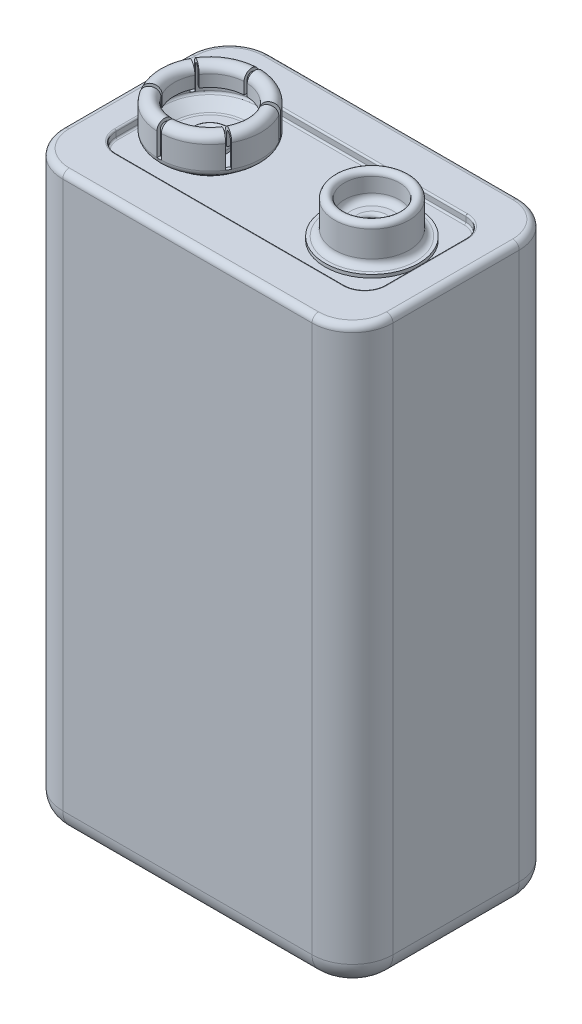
from build123d import *

# Parameters (mm, degrees)
SKETCH1_W         = 25.908
SKETCH1_H         = 16.256
EXTRUDE1_DEPTH    = 45.212
FILLET1_R         = 3.175
FILLET2_R         = 1.778
EXTRUDE2_DEPTH    = 0.635
FILLET3_R         = 0.508
FILLET4_R         = 0.127
REVOLVE3_ANGLE    = 55
CIRPATTERN1_COUNT = 6


with BuildPart() as part:
    # Sketch1 → Extrude1 (new body)
    with BuildSketch(Plane(origin=(0, 0, 0), x_dir=(1, 0, 0), z_dir=(0, 1, 0))):
        Rectangle(SKETCH1_W, SKETCH1_H)
    extrude(amount=EXTRUDE1_DEPTH)

    # Fillet1
    fillet1_edges = [part.edges().sort_by_distance(p)[0] for p in [
        (-12.954, 22.606, -8.128),
        (12.954, 22.606, -8.128),
        (12.954, 22.606, 8.128),
        (-12.954, 22.606, 8.128),
    ]]
    fillet(fillet1_edges, radius=FILLET1_R)

    # Fillet2
    fillet2_edges = [part.edges().sort_by_distance(p)[0] for p in [
        (0, 0, 8.128),
        (-12.954, 0, 0),
        (0, 0, -8.128),
        (12.954, 0, 0),
        (12.02406403, 0, 7.19806403),
        (12.02406403, 0, -7.19806403),
        (-12.02406403, 0, -7.19806403),
        (-12.02406403, 0, 7.19806403),
    ]]
    fillet(fillet2_edges, radius=FILLET2_R)

    # Sketch3 → Extrude2 (cut)
    with BuildSketch(Plane(origin=(0, 45.212, 0), x_dir=(1, 0, 0), z_dir=(0, 1, 0))):
        with BuildLine():
            Line((-8.9535, 4.7625), (8.9535, 4.7625))
            ThreePointArc((8.9535, 4.7625), (10.076032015, 4.297532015), (10.541, 3.175))
            Line((10.541, 3.175), (10.541, -3.175))
            ThreePointArc((10.541, -3.175), (10.076032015, -4.297532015), (8.9535, -4.7625))
            Line((8.9535, -4.7625), (-8.9535, -4.7625))
            ThreePointArc((-8.9535, -4.7625), (-10.076032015, -4.297532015), (-10.541, -3.175))
            Line((-10.541, -3.175), (-10.541, 3.175))
            ThreePointArc((-10.541, 3.175), (-10.076032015, 4.297532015), (-8.9535, 4.7625))
        make_face()
    extrude(amount=-EXTRUDE2_DEPTH, mode=Mode.SUBTRACT)

    # Fillet3
    fillet3_edges = [part.edges().sort_by_distance(p)[0] for p in [
        (0, 45.212, 8.128),
        (-12.954, 45.212, 0),
        (12.954, 45.212, 0),
        (0, 45.212, -8.128),
        (12.02406403, 45.212, 7.19806403),
        (12.02406403, 45.212, -7.19806403),
        (-12.02406403, 45.212, -7.19806403),
        (-12.02406403, 45.212, 7.19806403),
    ]]
    fillet(fillet3_edges, radius=FILLET3_R)

    # Fillet4
    fillet4_edges = [part.edges().sort_by_distance(p)[0] for p in [
        (-10.076032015, 44.577, -4.297532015),
        (0, 44.577, -4.7625),
        (10.076032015, 44.577, -4.297532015),
        (10.541, 44.577, 0),
        (10.076032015, 44.577, 4.297532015),
        (0, 44.577, 4.7625),
        (-10.076032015, 44.577, 4.297532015),
        (-10.541, 44.577, 0),
        (-10.076032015, 45.212, -4.297532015),
        (-10.541, 45.212, 0),
        (-10.076032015, 45.212, 4.297532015),
        (0, 45.212, 4.7625),
        (10.076032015, 45.212, 4.297532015),
        (10.541, 45.212, 0),
        (10.076032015, 45.212, -4.297532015),
        (0, 45.212, -4.7625),
    ]]
    fillet(fillet4_edges, radius=FILLET4_R)

    # Sketch7 → Revolve2 (revolve)
    with BuildSketch(Plane.XY, mode=Mode.PRIVATE) as revolve2_sk:
        with BuildLine():
            Line((-10.3505, 45.72), (-10.0965, 45.72))
            ThreePointArc((-10.0965, 45.72), (-10.070372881, 45.607795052), (-9.997366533, 45.518673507))
            Line((-9.997366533, 45.518673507), (-9.171866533, 44.883673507))
            ThreePointArc((-9.171866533, 44.883673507), (-9.09878958, 44.844528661), (-9.017, 44.831))
            Line((-9.017, 44.831), (-7.747, 44.831))
            Line((-7.747, 44.831), (-7.747, 45.085))
            ThreePointArc((-7.747, 45.085), (-7.493, 45.339), (-7.239, 45.085))
            Line((-7.239, 45.085), (-7.239, 44.577))
            Line((-7.239, 44.577), (-9.017, 44.577))
            ThreePointArc((-9.017, 44.577), (-9.18057916, 44.604057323), (-9.326733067, 44.682347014))
            Line((-9.326733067, 44.682347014), (-10.152233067, 45.317347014))
            ThreePointArc((-10.152233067, 45.317347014), (-10.298245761, 45.495590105), (-10.3505, 45.72))
        make_face()
    revolve(revolve2_sk.sketch.rotate(Axis((-6.35, 44.577, 0), (0, 1, 0)), 180), axis=Axis((-6.35, 44.577, 0), (0, 1, 0)))

    # Sketch6 → Revolve3 (revolve, symmetric)
    with BuildSketch(Plane.XY) as revolve3_sk:
        with BuildLine():
            Line((-10.3505, 45.72), (-10.0965, 45.72))
            Line((-10.0965, 45.72), (-10.0965, 47.52975))
            ThreePointArc((-10.0965, 47.52975), (-9.74725, 47.879), (-9.398, 47.52975))
            Line((-9.398, 47.52975), (-9.398, 46.609))
            Line((-9.398, 46.609), (-9.144, 46.609))
            Line((-9.144, 46.609), (-9.144, 47.52975))
            ThreePointArc((-9.144, 47.52975), (-9.74725, 48.133), (-10.3505, 47.52975))
            Line((-10.3505, 47.52975), (-10.3505, 45.72))
        make_face()
    revolve3 = revolve(axis=Axis((-6.35, 44.577, 0), (0, 1, 0)), revolution_arc=REVOLVE3_ANGLE / 2)
    revolve3 = revolve3 + revolve(revolve3_sk.sketch, axis=Axis((-6.35, 44.577, 0), (0, -1, 0)), revolution_arc=REVOLVE3_ANGLE / 2)

    # CirPattern1: Revolve3 ×6 about axis
    cirpattern1_axis = Axis((-6.35, 0, 0), (0, 1, 0))
    for i in range(1, CIRPATTERN1_COUNT):
        add(revolve3.rotate(cirpattern1_axis, i * 360 / CIRPATTERN1_COUNT))

    # Sketch8 → Revolve4 (revolve)
    with BuildSketch(Plane.XY, mode=Mode.PRIVATE) as revolve4_sk:
        with BuildLine():
            Line((2.667, 44.577), (2.667, 44.831))
            Line((2.667, 44.831), (2.921, 44.831))
            ThreePointArc((2.921, 44.831), (3.280210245, 44.979789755), (3.429, 45.339))
            Line((3.429, 45.339), (3.429, 47.371))
            ThreePointArc((3.429, 47.371), (3.81, 47.752), (4.191, 47.371))
            Line((4.191, 47.371), (4.191, 46.228))
            ThreePointArc((4.191, 46.228), (4.339789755, 45.868789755), (4.699, 45.72))
            Line((4.699, 45.72), (5.207, 45.72))
            ThreePointArc((5.207, 45.72), (5.386605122, 45.645605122), (5.461, 45.466))
            Line((5.461, 45.466), (5.461, 44.577))
            Line((5.461, 44.577), (2.667, 44.577))
        make_face()
    revolve(revolve4_sk.sketch.rotate(Axis((6.35, 44.577, 0), (0, 1, 0)), 180), axis=Axis((6.35, 44.577, 0), (0, 1, 0)))


solid = part.part
